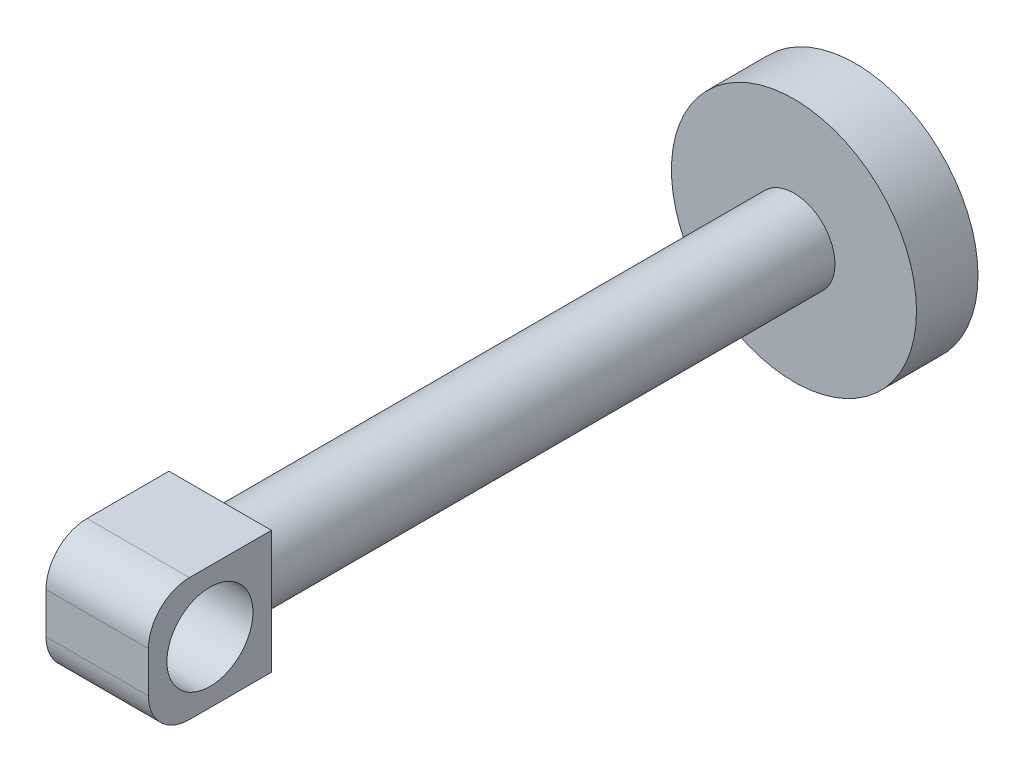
from build123d import *

# Parameters (mm, degrees)
SKETCH1_R           = 37.973
BOSS_EXTRUDE1_DEPTH = 19.05
SKETCH2_R           = 12.7
BOSS_EXTRUDE2_DEPTH = 177.8
SKETCH3_W           = 31.75
SKETCH3_H           = 38.1
BOSS_EXTRUDE3_DEPTH = 38.1
FILLET1_R           = 12.7
SKETCH4_R           = 13.335
CUT_EXTRUDE1_DEPTH  = 38.1


with BuildPart() as part:
    # Sketch1 → Boss-Extrude1 (new body)
    with BuildSketch(Plane.XY):
        Circle(SKETCH1_R)
    extrude(amount=-BOSS_EXTRUDE1_DEPTH)

    # Sketch2 → Boss-Extrude2 (add)
    with BuildSketch(Plane.XY):
        Circle(SKETCH2_R)
    extrude(amount=BOSS_EXTRUDE2_DEPTH)

    # Sketch3 → Boss-Extrude3 (add)
    with BuildSketch(Plane.XY.offset(177.8)):
        Rectangle(SKETCH3_W, SKETCH3_H)
    extrude(amount=BOSS_EXTRUDE3_DEPTH)

    # Fillet1
    fillet1_edges = [part.edges().sort_by_distance(p)[0] for p in [
        (0, 19.05, 215.9),
        (0, -19.05, 215.9),
    ]]
    fillet(fillet1_edges, radius=FILLET1_R)

    # Sketch4 → Cut-Extrude1 (cut)
    with BuildSketch(Plane(origin=(15.875, 0, 0), x_dir=(0, 0, -1), z_dir=(1, 0, 0))):
        with Locations((-196.85, 0)):
            Circle(SKETCH4_R)
    extrude(amount=-CUT_EXTRUDE1_DEPTH, mode=Mode.SUBTRACT)


solid = part.part
